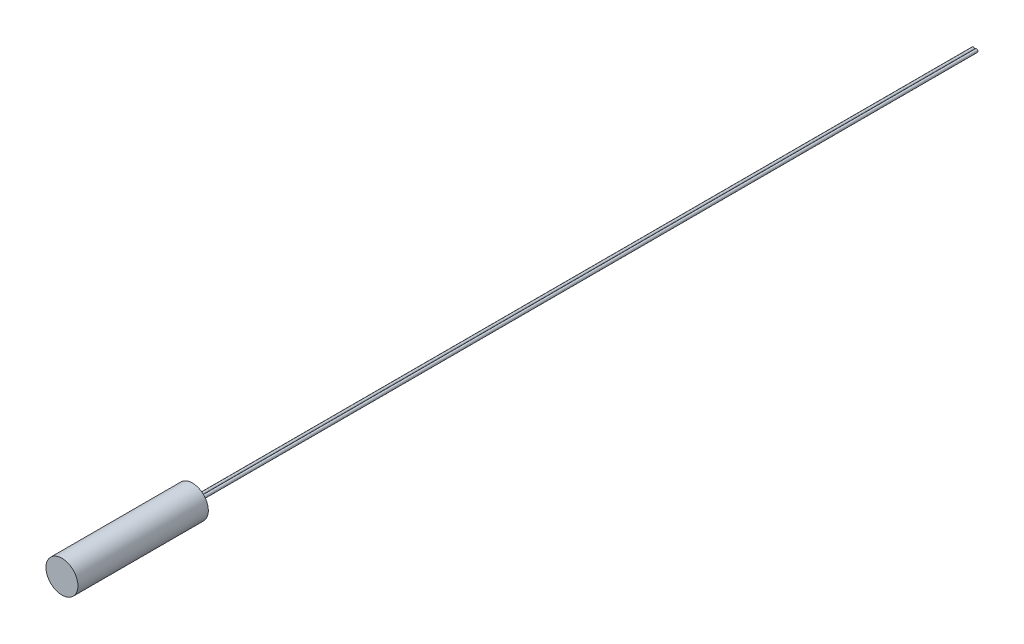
ISO-10303-21;
HEADER;
FILE_DESCRIPTION(('STEP AP214'),'2;1');
FILE_NAME('part.step','',(''),(''),'','','');
FILE_SCHEMA(('AUTOMOTIVE_DESIGN { 1 0 10303 214 1 1 1 1 }'));
ENDSEC;
DATA;
#1=APPLICATION_CONTEXT('core data for automotive mechanical design processes');
#2=APPLICATION_PROTOCOL_DEFINITION('international standard','automotive_design',2000,#1);
#3=PRODUCT_CONTEXT('',#1,'mechanical');
#4=PRODUCT('Part','Part','',(#3));
#5=PRODUCT_RELATED_PRODUCT_CATEGORY('part','',(#4));
#6=PRODUCT_DEFINITION_FORMATION('','',#4);
#7=PRODUCT_DEFINITION_CONTEXT('part definition',#1,'design');
#8=PRODUCT_DEFINITION('design','',#6,#7);
#9=PRODUCT_DEFINITION_SHAPE('','',#8);
#10=(LENGTH_UNIT() NAMED_UNIT(*) SI_UNIT(.MILLI.,.METRE.));
#11=(NAMED_UNIT(*) PLANE_ANGLE_UNIT() SI_UNIT($,.RADIAN.));
#12=(NAMED_UNIT(*) SI_UNIT($,.STERADIAN.) SOLID_ANGLE_UNIT());
#13=UNCERTAINTY_MEASURE_WITH_UNIT(LENGTH_MEASURE(1.E-05),#10,'distance_accuracy_value','');
#14=(GEOMETRIC_REPRESENTATION_CONTEXT(3) GLOBAL_UNCERTAINTY_ASSIGNED_CONTEXT((#13)) GLOBAL_UNIT_ASSIGNED_CONTEXT((#10,
#11,#12)) REPRESENTATION_CONTEXT('',''));
#15=CARTESIAN_POINT('',(0.,0.,0.));
#16=DIRECTION('',(0.,0.,1.));
#17=DIRECTION('',(1.,0.,0.));
#18=AXIS2_PLACEMENT_3D('',#15,#16,#17);
#19=CARTESIAN_POINT('',(0.,-3.1115,-25.4));
#20=DIRECTION('',(0.,0.,1.));
#21=DIRECTION('',(1.,0.,0.));
#22=AXIS2_PLACEMENT_3D('',#19,#20,#21);
#23=CYLINDRICAL_SURFACE('',#22,3.1115);
#24=CARTESIAN_POINT('',(0.,-3.1115,-25.4));
#25=DIRECTION('',(0.,0.,1.));
#26=DIRECTION('',(1.,0.,0.));
#27=AXIS2_PLACEMENT_3D('',#24,#25,#26);
#28=CIRCLE('',#27,3.1115);
#29=CARTESIAN_POINT('',(3.1115,-3.1115,-25.4));
#30=VERTEX_POINT('',#29);
#31=EDGE_CURVE('E40',#30,#30,#28,.T.);
#32=ORIENTED_EDGE('',*,*,#31,.T.);
#33=EDGE_LOOP('',(#32));
#34=FACE_BOUND('',#33,.T.);
#35=CARTESIAN_POINT('',(0.,-3.1115,0.));
#36=DIRECTION('',(0.,0.,1.));
#37=DIRECTION('',(1.,0.,0.));
#38=AXIS2_PLACEMENT_3D('',#35,#36,#37);
#39=CIRCLE('',#38,3.1115);
#40=CARTESIAN_POINT('',(3.1115,-3.1115,0.));
#41=VERTEX_POINT('',#40);
#42=EDGE_CURVE('E44',#41,#41,#39,.T.);
#43=ORIENTED_EDGE('',*,*,#42,.F.);
#44=EDGE_LOOP('',(#43));
#45=FACE_BOUND('',#44,.T.);
#46=ADVANCED_FACE('F30',(#34,#45),#23,.T.);
#47=CARTESIAN_POINT('',(0.,-3.1115,-25.4));
#48=DIRECTION('',(0.,0.,1.));
#49=DIRECTION('',(1.,0.,0.));
#50=AXIS2_PLACEMENT_3D('',#47,#48,#49);
#51=PLANE('',#50);
#52=CARTESIAN_POINT('',(-0.302999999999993,-3.1115,-25.4));
#53=DIRECTION('',(0.,0.,1.));
#54=DIRECTION('',(1.,0.,0.));
#55=AXIS2_PLACEMENT_3D('',#52,#53,#54);
#56=CIRCLE('',#55,0.299999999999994);
#57=CARTESIAN_POINT('',(-0.00299999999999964,-3.1115,-25.4));
#58=VERTEX_POINT('',#57);
#59=EDGE_CURVE('E10',#58,#58,#56,.F.);
#60=ORIENTED_EDGE('',*,*,#59,.F.);
#61=EDGE_LOOP('',(#60));
#62=FACE_BOUND('',#61,.T.);
#63=CARTESIAN_POINT('',(0.302999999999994,-3.1115,-25.4));
#64=DIRECTION('',(0.,0.,1.));
#65=DIRECTION('',(1.,0.,0.));
#66=AXIS2_PLACEMENT_3D('',#63,#64,#65);
#67=CIRCLE('',#66,0.299999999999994);
#68=CARTESIAN_POINT('',(0.602999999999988,-3.1115,-25.4));
#69=VERTEX_POINT('',#68);
#70=EDGE_CURVE('E36',#69,#69,#67,.F.);
#71=ORIENTED_EDGE('',*,*,#70,.F.);
#72=EDGE_LOOP('',(#71));
#73=FACE_BOUND('',#72,.T.);
#74=ORIENTED_EDGE('',*,*,#31,.F.);
#75=EDGE_LOOP('',(#74));
#76=FACE_BOUND('',#75,.T.);
#77=ADVANCED_FACE('F71',(#62,#73,#76),#51,.F.);
#78=CARTESIAN_POINT('',(0.,-3.1115,0.));
#79=DIRECTION('',(0.,0.,1.));
#80=DIRECTION('',(1.,0.,0.));
#81=AXIS2_PLACEMENT_3D('',#78,#79,#80);
#82=PLANE('',#81);
#83=ORIENTED_EDGE('',*,*,#42,.T.);
#84=EDGE_LOOP('',(#83));
#85=FACE_BOUND('',#84,.T.);
#86=ADVANCED_FACE('F76',(#85),#82,.T.);
#87=CARTESIAN_POINT('',(0.302999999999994,-3.1115,-177.8));
#88=DIRECTION('',(0.,0.,1.));
#89=DIRECTION('',(1.,0.,0.));
#90=AXIS2_PLACEMENT_3D('',#87,#88,#89);
#91=CYLINDRICAL_SURFACE('',#90,0.299999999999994);
#92=CARTESIAN_POINT('',(0.302999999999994,-3.1115,-177.8));
#93=DIRECTION('',(0.,0.,-1.));
#94=DIRECTION('',(-1.,0.,0.));
#95=AXIS2_PLACEMENT_3D('',#92,#93,#94);
#96=CIRCLE('',#95,0.299999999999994);
#97=CARTESIAN_POINT('',(0.00300000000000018,-3.1115,-177.8));
#98=VERTEX_POINT('',#97);
#99=EDGE_CURVE('E48',#98,#98,#96,.T.);
#100=ORIENTED_EDGE('',*,*,#99,.F.);
#101=EDGE_LOOP('',(#100));
#102=FACE_BOUND('',#101,.T.);
#103=ORIENTED_EDGE('',*,*,#70,.T.);
#104=EDGE_LOOP('',(#103));
#105=FACE_BOUND('',#104,.T.);
#106=ADVANCED_FACE('F67',(#102,#105),#91,.T.);
#107=CARTESIAN_POINT('',(0.302999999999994,-3.1115,-177.8));
#108=DIRECTION('',(0.,0.,-1.));
#109=DIRECTION('',(-1.,0.,0.));
#110=AXIS2_PLACEMENT_3D('',#107,#108,#109);
#111=PLANE('',#110);
#112=ORIENTED_EDGE('',*,*,#99,.T.);
#113=EDGE_LOOP('',(#112));
#114=FACE_BOUND('',#113,.T.);
#115=ADVANCED_FACE('F60',(#114),#111,.T.);
#116=CARTESIAN_POINT('',(-0.302999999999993,-3.1115,-177.8));
#117=DIRECTION('',(0.,0.,1.));
#118=DIRECTION('',(1.,0.,0.));
#119=AXIS2_PLACEMENT_3D('',#116,#117,#118);
#120=CYLINDRICAL_SURFACE('',#119,0.299999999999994);
#121=CARTESIAN_POINT('',(-0.302999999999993,-3.1115,-177.8));
#122=DIRECTION('',(0.,0.,-1.));
#123=DIRECTION('',(-1.,0.,0.));
#124=AXIS2_PLACEMENT_3D('',#121,#122,#123);
#125=CIRCLE('',#124,0.299999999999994);
#126=CARTESIAN_POINT('',(-0.602999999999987,-3.1115,-177.8));
#127=VERTEX_POINT('',#126);
#128=EDGE_CURVE('E52',#127,#127,#125,.T.);
#129=ORIENTED_EDGE('',*,*,#128,.F.);
#130=EDGE_LOOP('',(#129));
#131=FACE_BOUND('',#130,.T.);
#132=ORIENTED_EDGE('',*,*,#59,.T.);
#133=EDGE_LOOP('',(#132));
#134=FACE_BOUND('',#133,.T.);
#135=ADVANCED_FACE('F58',(#131,#134),#120,.T.);
#136=CARTESIAN_POINT('',(-0.302999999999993,-3.1115,-177.8));
#137=DIRECTION('',(0.,0.,-1.));
#138=DIRECTION('',(-1.,0.,0.));
#139=AXIS2_PLACEMENT_3D('',#136,#137,#138);
#140=PLANE('',#139);
#141=ORIENTED_EDGE('',*,*,#128,.T.);
#142=EDGE_LOOP('',(#141));
#143=FACE_BOUND('',#142,.T.);
#144=ADVANCED_FACE('F56',(#143),#140,.T.);
#145=CLOSED_SHELL('',(#46,#77,#86,#106,#115,#135,#144));
#146=MANIFOLD_SOLID_BREP('B2',#145);
#147=ADVANCED_BREP_SHAPE_REPRESENTATION('',(#18,#146),#14);
#148=SHAPE_DEFINITION_REPRESENTATION(#9,#147);
ENDSEC;
END-ISO-10303-21;
